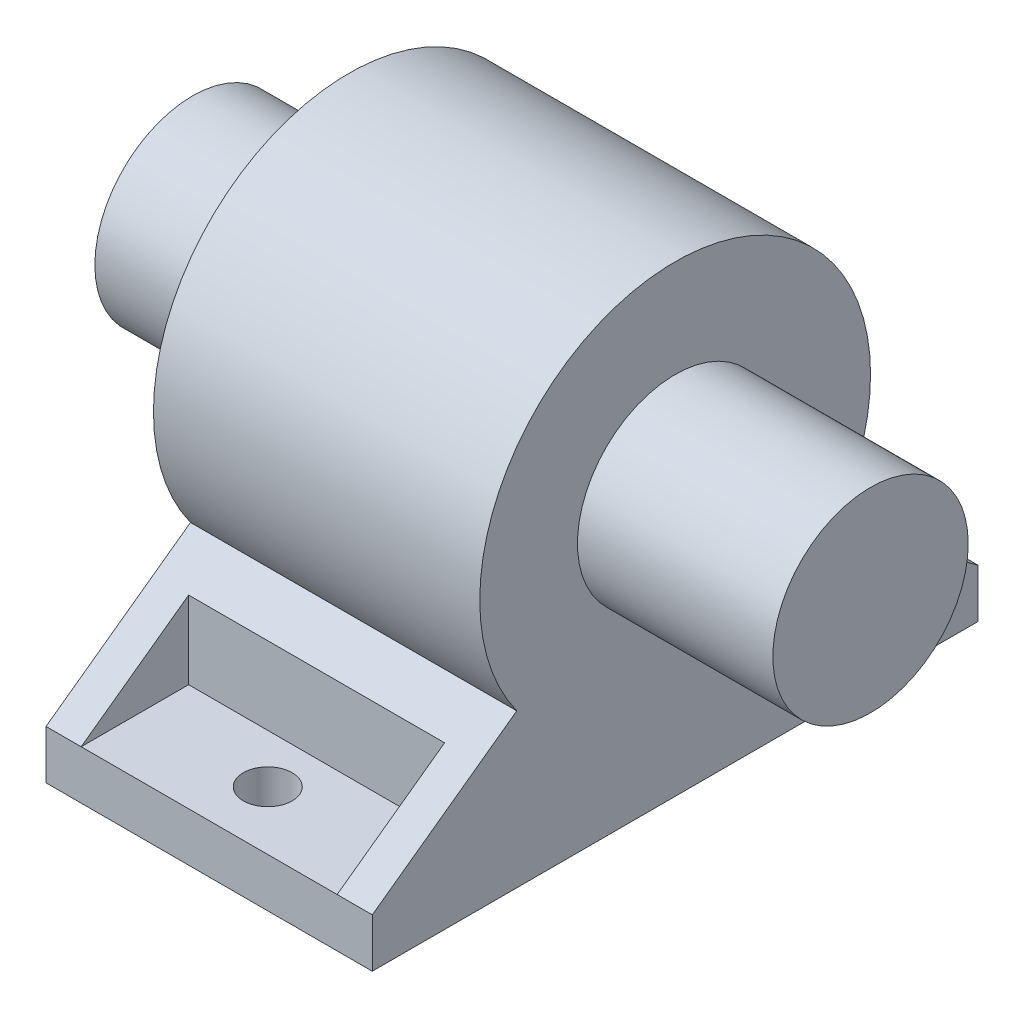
ISO-10303-21;
HEADER;
FILE_DESCRIPTION(('STEP AP214'),'2;1');
FILE_NAME('part.step','',(''),(''),'','','');
FILE_SCHEMA(('AUTOMOTIVE_DESIGN { 1 0 10303 214 1 1 1 1 }'));
ENDSEC;
DATA;
#1=APPLICATION_CONTEXT('core data for automotive mechanical design processes');
#2=APPLICATION_PROTOCOL_DEFINITION('international standard','automotive_design',2000,#1);
#3=PRODUCT_CONTEXT('',#1,'mechanical');
#4=PRODUCT('Part','Part','',(#3));
#5=PRODUCT_RELATED_PRODUCT_CATEGORY('part','',(#4));
#6=PRODUCT_DEFINITION_FORMATION('','',#4);
#7=PRODUCT_DEFINITION_CONTEXT('part definition',#1,'design');
#8=PRODUCT_DEFINITION('design','',#6,#7);
#9=PRODUCT_DEFINITION_SHAPE('','',#8);
#10=(LENGTH_UNIT() NAMED_UNIT(*) SI_UNIT(.MILLI.,.METRE.));
#11=(NAMED_UNIT(*) PLANE_ANGLE_UNIT() SI_UNIT($,.RADIAN.));
#12=(NAMED_UNIT(*) SI_UNIT($,.STERADIAN.) SOLID_ANGLE_UNIT());
#13=UNCERTAINTY_MEASURE_WITH_UNIT(LENGTH_MEASURE(1.E-05),#10,'distance_accuracy_value','');
#14=(GEOMETRIC_REPRESENTATION_CONTEXT(3) GLOBAL_UNCERTAINTY_ASSIGNED_CONTEXT((#13)) GLOBAL_UNIT_ASSIGNED_CONTEXT((#10,
#11,#12)) REPRESENTATION_CONTEXT('',''));
#15=CARTESIAN_POINT('',(0.,0.,0.));
#16=DIRECTION('',(0.,0.,1.));
#17=DIRECTION('',(1.,0.,0.));
#18=AXIS2_PLACEMENT_3D('',#15,#16,#17);
#19=CARTESIAN_POINT('',(42.418,-28.448,39.37));
#20=DIRECTION('',(0.,0.,-1.));
#21=DIRECTION('',(0.,1.,0.));
#22=AXIS2_PLACEMENT_3D('',#19,#20,#21);
#23=PLANE('',#22);
#24=DIRECTION('',(0.,-1.,0.));
#25=VECTOR('',#24,1.);
#26=CARTESIAN_POINT('',(0.,-28.448,39.37));
#27=LINE('',#26,#25);
#28=CARTESIAN_POINT('',(0.,-28.448,39.37));
#29=VERTEX_POINT('',#28);
#30=CARTESIAN_POINT('',(0.,-34.798,39.37));
#31=VERTEX_POINT('',#30);
#32=EDGE_CURVE('E229',#29,#31,#27,.T.);
#33=ORIENTED_EDGE('',*,*,#32,.T.);
#34=DIRECTION('',(-1.,0.,0.));
#35=VECTOR('',#34,1.);
#36=CARTESIAN_POINT('',(42.418,-34.798,39.37));
#37=LINE('',#36,#35);
#38=CARTESIAN_POINT('',(42.418,-34.798,39.37));
#39=VERTEX_POINT('',#38);
#40=EDGE_CURVE('E176',#39,#31,#37,.T.);
#41=ORIENTED_EDGE('',*,*,#40,.F.);
#42=DIRECTION('',(0.,-1.,0.));
#43=VECTOR('',#42,1.);
#44=CARTESIAN_POINT('',(42.418,-28.448,39.37));
#45=LINE('',#44,#43);
#46=CARTESIAN_POINT('',(42.418,-28.448,39.37));
#47=VERTEX_POINT('',#46);
#48=EDGE_CURVE('E155',#47,#39,#45,.T.);
#49=ORIENTED_EDGE('',*,*,#48,.F.);
#50=DIRECTION('',(-1.,0.,0.));
#51=VECTOR('',#50,1.);
#52=CARTESIAN_POINT('',(42.418,-28.448,39.37));
#53=LINE('',#52,#51);
#54=CARTESIAN_POINT('',(37.846,-28.448,39.37));
#55=VERTEX_POINT('',#54);
#56=EDGE_CURVE('E148',#47,#55,#53,.T.);
#57=ORIENTED_EDGE('',*,*,#56,.T.);
#58=DIRECTION('',(-1.,0.,0.));
#59=VECTOR('',#58,1.);
#60=CARTESIAN_POINT('',(4.57200000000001,-28.448,39.37));
#61=LINE('',#60,#59);
#62=CARTESIAN_POINT('',(4.57200000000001,-28.448,39.37));
#63=VERTEX_POINT('',#62);
#64=EDGE_CURVE('E136',#55,#63,#61,.T.);
#65=ORIENTED_EDGE('',*,*,#64,.T.);
#66=EDGE_CURVE('E157',#63,#29,#53,.T.);
#67=ORIENTED_EDGE('',*,*,#66,.T.);
#68=EDGE_LOOP('',(#33,#41,#49,#57,#65,#67));
#69=FACE_BOUND('',#68,.T.);
#70=ADVANCED_FACE('F34',(#69),#23,.F.);
#71=CARTESIAN_POINT('',(42.418,-34.798,39.37));
#72=DIRECTION('',(0.,1.,0.));
#73=DIRECTION('',(0.,0.,1.));
#74=AXIS2_PLACEMENT_3D('',#71,#72,#73);
#75=PLANE('',#74);
#76=CARTESIAN_POINT('',(21.209,-34.798,-31.75));
#77=DIRECTION('',(0.,1.,0.));
#78=DIRECTION('',(0.,0.,1.));
#79=AXIS2_PLACEMENT_3D('',#76,#77,#78);
#80=CIRCLE('',#79,3.175);
#81=CARTESIAN_POINT('',(21.209,-34.798,-28.575));
#82=VERTEX_POINT('',#81);
#83=EDGE_CURVE('E183',#82,#82,#80,.T.);
#84=ORIENTED_EDGE('',*,*,#83,.T.);
#85=EDGE_LOOP('',(#84));
#86=FACE_BOUND('',#85,.T.);
#87=CARTESIAN_POINT('',(21.209,-34.798,31.75));
#88=DIRECTION('',(0.,1.,0.));
#89=DIRECTION('',(0.,0.,1.));
#90=AXIS2_PLACEMENT_3D('',#87,#88,#89);
#91=CIRCLE('',#90,3.175);
#92=CARTESIAN_POINT('',(21.209,-34.798,34.925));
#93=VERTEX_POINT('',#92);
#94=EDGE_CURVE('E189',#93,#93,#91,.T.);
#95=ORIENTED_EDGE('',*,*,#94,.T.);
#96=EDGE_LOOP('',(#95));
#97=FACE_BOUND('',#96,.T.);
#98=DIRECTION('',(0.,0.,-1.));
#99=VECTOR('',#98,1.);
#100=CARTESIAN_POINT('',(0.,-34.798,39.37));
#101=LINE('',#100,#99);
#102=CARTESIAN_POINT('',(0.,-34.798,-39.37));
#103=VERTEX_POINT('',#102);
#104=EDGE_CURVE('E243',#31,#103,#101,.T.);
#105=ORIENTED_EDGE('',*,*,#104,.T.);
#106=DIRECTION('',(-1.,0.,0.));
#107=VECTOR('',#106,1.);
#108=CARTESIAN_POINT('',(42.418,-34.798,-39.37));
#109=LINE('',#108,#107);
#110=CARTESIAN_POINT('',(42.418,-34.798,-39.37));
#111=VERTEX_POINT('',#110);
#112=EDGE_CURVE('E173',#111,#103,#109,.T.);
#113=ORIENTED_EDGE('',*,*,#112,.F.);
#114=DIRECTION('',(0.,0.,-1.));
#115=VECTOR('',#114,1.);
#116=CARTESIAN_POINT('',(42.418,-34.798,39.37));
#117=LINE('',#116,#115);
#118=EDGE_CURVE('E233',#39,#111,#117,.T.);
#119=ORIENTED_EDGE('',*,*,#118,.F.);
#120=ORIENTED_EDGE('',*,*,#40,.T.);
#121=EDGE_LOOP('',(#105,#113,#119,#120));
#122=FACE_BOUND('',#121,.T.);
#123=ADVANCED_FACE('F260',(#86,#97,#122),#75,.F.);
#124=CARTESIAN_POINT('',(42.418,-34.798,-39.37));
#125=DIRECTION('',(0.,0.,1.));
#126=DIRECTION('',(0.,-1.,0.));
#127=AXIS2_PLACEMENT_3D('',#124,#125,#126);
#128=PLANE('',#127);
#129=DIRECTION('',(0.,1.,0.));
#130=VECTOR('',#129,1.);
#131=CARTESIAN_POINT('',(0.,-34.798,-39.37));
#132=LINE('',#131,#130);
#133=CARTESIAN_POINT('',(0.,-28.448,-39.37));
#134=VERTEX_POINT('',#133);
#135=EDGE_CURVE('E245',#103,#134,#132,.T.);
#136=ORIENTED_EDGE('',*,*,#135,.T.);
#137=DIRECTION('',(-1.,0.,0.));
#138=VECTOR('',#137,1.);
#139=CARTESIAN_POINT('',(42.418,-28.448,-39.37));
#140=LINE('',#139,#138);
#141=CARTESIAN_POINT('',(4.572,-28.448,-39.37));
#142=VERTEX_POINT('',#141);
#143=EDGE_CURVE('E169',#142,#134,#140,.T.);
#144=ORIENTED_EDGE('',*,*,#143,.F.);
#145=DIRECTION('',(1.,0.,0.));
#146=VECTOR('',#145,1.);
#147=CARTESIAN_POINT('',(4.572,-28.448,-39.37));
#148=LINE('',#147,#146);
#149=CARTESIAN_POINT('',(37.846,-28.448,-39.37));
#150=VERTEX_POINT('',#149);
#151=EDGE_CURVE('E203',#142,#150,#148,.T.);
#152=ORIENTED_EDGE('',*,*,#151,.T.);
#153=CARTESIAN_POINT('',(42.418,-28.448,-39.37));
#154=VERTEX_POINT('',#153);
#155=EDGE_CURVE('E170',#154,#150,#140,.T.);
#156=ORIENTED_EDGE('',*,*,#155,.F.);
#157=DIRECTION('',(0.,1.,0.));
#158=VECTOR('',#157,1.);
#159=CARTESIAN_POINT('',(42.418,-34.798,-39.37));
#160=LINE('',#159,#158);
#161=EDGE_CURVE('E235',#111,#154,#160,.T.);
#162=ORIENTED_EDGE('',*,*,#161,.F.);
#163=ORIENTED_EDGE('',*,*,#112,.T.);
#164=EDGE_LOOP('',(#136,#144,#152,#156,#162,#163));
#165=FACE_BOUND('',#164,.T.);
#166=ADVANCED_FACE('F277',(#165),#128,.F.);
#167=CARTESIAN_POINT('',(42.418,-28.448,-39.37));
#168=DIRECTION('',(0.,-0.810541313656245,0.585681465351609));
#169=DIRECTION('',(0.,-0.585681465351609,-0.810541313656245));
#170=AXIS2_PLACEMENT_3D('',#167,#168,#169);
#171=PLANE('',#170);
#172=DIRECTION('',(-1.,0.,0.));
#173=VECTOR('',#172,1.);
#174=CARTESIAN_POINT('',(42.418,-18.3535483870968,-25.4));
#175=LINE('',#174,#173);
#176=CARTESIAN_POINT('',(37.846,-18.3535483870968,-25.4));
#177=VERTEX_POINT('',#176);
#178=CARTESIAN_POINT('',(4.572,-18.3535483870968,-25.4));
#179=VERTEX_POINT('',#178);
#180=EDGE_CURVE('E140',#177,#179,#175,.T.);
#181=ORIENTED_EDGE('',*,*,#180,.T.);
#182=DIRECTION('',(0.,-0.585681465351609,-0.810541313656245));
#183=VECTOR('',#182,1.);
#184=CARTESIAN_POINT('',(4.572,-28.448,-39.37));
#185=LINE('',#184,#183);
#186=EDGE_CURVE('E219',#179,#142,#185,.T.);
#187=ORIENTED_EDGE('',*,*,#186,.T.);
#188=ORIENTED_EDGE('',*,*,#143,.T.);
#189=DIRECTION('',(0.,0.585681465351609,0.810541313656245));
#190=VECTOR('',#189,1.);
#191=CARTESIAN_POINT('',(0.,-28.448,-39.37));
#192=LINE('',#191,#190);
#193=CARTESIAN_POINT('',(0.,-14.8763092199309,-20.5877493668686));
#194=VERTEX_POINT('',#193);
#195=EDGE_CURVE('E248',#134,#194,#192,.T.);
#196=ORIENTED_EDGE('',*,*,#195,.T.);
#197=DIRECTION('',(-1.,0.,0.));
#198=VECTOR('',#197,1.);
#199=CARTESIAN_POINT('',(42.418,-14.8763092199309,-20.5877493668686));
#200=LINE('',#199,#198);
#201=CARTESIAN_POINT('',(42.418,-14.8763092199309,-20.5877493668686));
#202=VERTEX_POINT('',#201);
#203=EDGE_CURVE('E160',#202,#194,#200,.T.);
#204=ORIENTED_EDGE('',*,*,#203,.F.);
#205=DIRECTION('',(0.,0.585681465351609,0.810541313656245));
#206=VECTOR('',#205,1.);
#207=CARTESIAN_POINT('',(42.418,-28.448,-39.37));
#208=LINE('',#207,#206);
#209=EDGE_CURVE('E237',#154,#202,#208,.T.);
#210=ORIENTED_EDGE('',*,*,#209,.F.);
#211=ORIENTED_EDGE('',*,*,#155,.T.);
#212=DIRECTION('',(0.,0.585681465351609,0.810541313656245));
#213=VECTOR('',#212,1.);
#214=CARTESIAN_POINT('',(37.846,-28.448,-39.37));
#215=LINE('',#214,#213);
#216=EDGE_CURVE('E216',#150,#177,#215,.T.);
#217=ORIENTED_EDGE('',*,*,#216,.T.);
#218=EDGE_LOOP('',(#181,#187,#188,#196,#204,#210,#211,#217));
#219=FACE_BOUND('',#218,.T.);
#220=ADVANCED_FACE('F270',(#219),#171,.F.);
#221=CARTESIAN_POINT('',(42.418,0.,0.));
#222=DIRECTION('',(-1.,0.,0.));
#223=DIRECTION('',(0.,0.,1.));
#224=AXIS2_PLACEMENT_3D('',#221,#222,#223);
#225=CYLINDRICAL_SURFACE('',#224,25.4);
#226=CARTESIAN_POINT('',(0.,0.,0.));
#227=DIRECTION('',(1.,0.,0.));
#228=DIRECTION('',(0.,0.,-1.));
#229=AXIS2_PLACEMENT_3D('',#226,#227,#228);
#230=CIRCLE('',#229,25.4);
#231=CARTESIAN_POINT('',(0.,-14.8763092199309,20.5877493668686));
#232=VERTEX_POINT('',#231);
#233=EDGE_CURVE('E249',#194,#232,#230,.T.);
#234=ORIENTED_EDGE('',*,*,#233,.T.);
#235=DIRECTION('',(-1.,0.,0.));
#236=VECTOR('',#235,1.);
#237=CARTESIAN_POINT('',(42.418,-14.8763092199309,20.5877493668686));
#238=LINE('',#237,#236);
#239=CARTESIAN_POINT('',(42.418,-14.8763092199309,20.5877493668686));
#240=VERTEX_POINT('',#239);
#241=EDGE_CURVE('E156',#240,#232,#238,.T.);
#242=ORIENTED_EDGE('',*,*,#241,.F.);
#243=CARTESIAN_POINT('',(42.418,0.,0.));
#244=DIRECTION('',(1.,0.,0.));
#245=DIRECTION('',(0.,0.,-1.));
#246=AXIS2_PLACEMENT_3D('',#243,#244,#245);
#247=CIRCLE('',#246,25.4);
#248=EDGE_CURVE('E239',#202,#240,#247,.T.);
#249=ORIENTED_EDGE('',*,*,#248,.F.);
#250=ORIENTED_EDGE('',*,*,#203,.T.);
#251=EDGE_LOOP('',(#234,#242,#249,#250));
#252=FACE_BOUND('',#251,.T.);
#253=ADVANCED_FACE('F268',(#252),#225,.T.);
#254=CARTESIAN_POINT('',(42.418,-14.8763092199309,20.5877493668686));
#255=DIRECTION('',(0.,-0.810541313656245,-0.585681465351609));
#256=DIRECTION('',(0.,0.585681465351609,-0.810541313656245));
#257=AXIS2_PLACEMENT_3D('',#254,#255,#256);
#258=PLANE('',#257);
#259=ORIENTED_EDGE('',*,*,#66,.F.);
#260=DIRECTION('',(0.,0.585681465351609,-0.810541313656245));
#261=VECTOR('',#260,1.);
#262=CARTESIAN_POINT('',(4.57200000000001,-14.8763092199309,20.5877493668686));
#263=LINE('',#262,#261);
#264=CARTESIAN_POINT('',(4.57200000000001,-18.3535483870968,25.4));
#265=VERTEX_POINT('',#264);
#266=EDGE_CURVE('E12',#63,#265,#263,.T.);
#267=ORIENTED_EDGE('',*,*,#266,.T.);
#268=DIRECTION('',(1.,0.,0.));
#269=VECTOR('',#268,1.);
#270=CARTESIAN_POINT('',(42.418,-18.3535483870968,25.4));
#271=LINE('',#270,#269);
#272=CARTESIAN_POINT('',(37.846,-18.3535483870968,25.4));
#273=VERTEX_POINT('',#272);
#274=EDGE_CURVE('E42',#265,#273,#271,.T.);
#275=ORIENTED_EDGE('',*,*,#274,.T.);
#276=DIRECTION('',(0.,-0.585681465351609,0.810541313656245));
#277=VECTOR('',#276,1.);
#278=CARTESIAN_POINT('',(37.846,-14.8763092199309,20.5877493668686));
#279=LINE('',#278,#277);
#280=EDGE_CURVE('E129',#273,#55,#279,.T.);
#281=ORIENTED_EDGE('',*,*,#280,.T.);
#282=ORIENTED_EDGE('',*,*,#56,.F.);
#283=DIRECTION('',(0.,-0.585681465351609,0.810541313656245));
#284=VECTOR('',#283,1.);
#285=CARTESIAN_POINT('',(42.418,-14.8763092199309,20.5877493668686));
#286=LINE('',#285,#284);
#287=EDGE_CURVE('E162',#240,#47,#286,.T.);
#288=ORIENTED_EDGE('',*,*,#287,.F.);
#289=ORIENTED_EDGE('',*,*,#241,.T.);
#290=DIRECTION('',(0.,-0.585681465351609,0.810541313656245));
#291=VECTOR('',#290,1.);
#292=CARTESIAN_POINT('',(0.,-14.8763092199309,20.5877493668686));
#293=LINE('',#292,#291);
#294=EDGE_CURVE('E164',#232,#29,#293,.T.);
#295=ORIENTED_EDGE('',*,*,#294,.T.);
#296=EDGE_LOOP('',(#259,#267,#275,#281,#282,#288,#289,#295));
#297=FACE_BOUND('',#296,.T.);
#298=ADVANCED_FACE('F146',(#297),#258,.F.);
#299=CARTESIAN_POINT('',(42.418,0.,0.));
#300=DIRECTION('',(1.,0.,0.));
#301=DIRECTION('',(0.,0.,-1.));
#302=AXIS2_PLACEMENT_3D('',#299,#300,#301);
#303=PLANE('',#302);
#304=CARTESIAN_POINT('',(42.418,0.,0.));
#305=DIRECTION('',(1.,0.,0.));
#306=DIRECTION('',(0.,0.,-1.));
#307=AXIS2_PLACEMENT_3D('',#304,#305,#306);
#308=CIRCLE('',#307,12.7);
#309=CARTESIAN_POINT('',(42.418,0.,-12.7));
#310=VERTEX_POINT('',#309);
#311=EDGE_CURVE('E225',#310,#310,#308,.T.);
#312=ORIENTED_EDGE('',*,*,#311,.F.);
#313=EDGE_LOOP('',(#312));
#314=FACE_BOUND('',#313,.T.);
#315=ORIENTED_EDGE('',*,*,#48,.T.);
#316=ORIENTED_EDGE('',*,*,#118,.T.);
#317=ORIENTED_EDGE('',*,*,#161,.T.);
#318=ORIENTED_EDGE('',*,*,#209,.T.);
#319=ORIENTED_EDGE('',*,*,#248,.T.);
#320=ORIENTED_EDGE('',*,*,#287,.T.);
#321=EDGE_LOOP('',(#315,#316,#317,#318,#319,#320));
#322=FACE_BOUND('',#321,.T.);
#323=ADVANCED_FACE('F264',(#314,#322),#303,.T.);
#324=CARTESIAN_POINT('',(0.,0.,0.));
#325=DIRECTION('',(1.,0.,0.));
#326=DIRECTION('',(0.,0.,-1.));
#327=AXIS2_PLACEMENT_3D('',#324,#325,#326);
#328=PLANE('',#327);
#329=CARTESIAN_POINT('',(0.,0.,0.));
#330=DIRECTION('',(1.,0.,0.));
#331=DIRECTION('',(0.,0.,-1.));
#332=AXIS2_PLACEMENT_3D('',#329,#330,#331);
#333=CIRCLE('',#332,12.7);
#334=CARTESIAN_POINT('',(0.,0.,-12.7));
#335=VERTEX_POINT('',#334);
#336=EDGE_CURVE('E150',#335,#335,#333,.F.);
#337=ORIENTED_EDGE('',*,*,#336,.F.);
#338=EDGE_LOOP('',(#337));
#339=FACE_BOUND('',#338,.T.);
#340=ORIENTED_EDGE('',*,*,#32,.F.);
#341=ORIENTED_EDGE('',*,*,#294,.F.);
#342=ORIENTED_EDGE('',*,*,#233,.F.);
#343=ORIENTED_EDGE('',*,*,#195,.F.);
#344=ORIENTED_EDGE('',*,*,#135,.F.);
#345=ORIENTED_EDGE('',*,*,#104,.F.);
#346=EDGE_LOOP('',(#340,#341,#342,#343,#344,#345));
#347=FACE_BOUND('',#346,.T.);
#348=ADVANCED_FACE('F257',(#339,#347),#328,.F.);
#349=CARTESIAN_POINT('',(67.818,0.,0.));
#350=DIRECTION('',(-1.,0.,0.));
#351=DIRECTION('',(0.,0.,1.));
#352=AXIS2_PLACEMENT_3D('',#349,#350,#351);
#353=CYLINDRICAL_SURFACE('',#352,12.7);
#354=CARTESIAN_POINT('',(67.818,0.,0.));
#355=DIRECTION('',(1.,0.,0.));
#356=DIRECTION('',(0.,0.,-1.));
#357=AXIS2_PLACEMENT_3D('',#354,#355,#356);
#358=CIRCLE('',#357,12.7);
#359=CARTESIAN_POINT('',(67.818,0.,-12.7));
#360=VERTEX_POINT('',#359);
#361=EDGE_CURVE('E226',#360,#360,#358,.T.);
#362=ORIENTED_EDGE('',*,*,#361,.F.);
#363=EDGE_LOOP('',(#362));
#364=FACE_BOUND('',#363,.T.);
#365=ORIENTED_EDGE('',*,*,#311,.T.);
#366=EDGE_LOOP('',(#365));
#367=FACE_BOUND('',#366,.T.);
#368=ADVANCED_FACE('F343',(#364,#367),#353,.T.);
#369=CARTESIAN_POINT('',(67.818,0.,0.));
#370=DIRECTION('',(1.,0.,0.));
#371=DIRECTION('',(0.,0.,-1.));
#372=AXIS2_PLACEMENT_3D('',#369,#370,#371);
#373=PLANE('',#372);
#374=ORIENTED_EDGE('',*,*,#361,.T.);
#375=EDGE_LOOP('',(#374));
#376=FACE_BOUND('',#375,.T.);
#377=ADVANCED_FACE('F339',(#376),#373,.T.);
#378=CARTESIAN_POINT('',(-20.32,0.,0.));
#379=DIRECTION('',(1.,0.,0.));
#380=DIRECTION('',(0.,0.,-1.));
#381=AXIS2_PLACEMENT_3D('',#378,#379,#380);
#382=CYLINDRICAL_SURFACE('',#381,12.7);
#383=CARTESIAN_POINT('',(-20.32,0.,0.));
#384=DIRECTION('',(-1.,0.,0.));
#385=DIRECTION('',(0.,0.,1.));
#386=AXIS2_PLACEMENT_3D('',#383,#384,#385);
#387=CIRCLE('',#386,12.7);
#388=CARTESIAN_POINT('',(-20.32,0.,12.7));
#389=VERTEX_POINT('',#388);
#390=EDGE_CURVE('E222',#389,#389,#387,.T.);
#391=ORIENTED_EDGE('',*,*,#390,.F.);
#392=EDGE_LOOP('',(#391));
#393=FACE_BOUND('',#392,.T.);
#394=ORIENTED_EDGE('',*,*,#336,.T.);
#395=EDGE_LOOP('',(#394));
#396=FACE_BOUND('',#395,.T.);
#397=ADVANCED_FACE('F335',(#393,#396),#382,.T.);
#398=CARTESIAN_POINT('',(-20.32,0.,0.));
#399=DIRECTION('',(-1.,0.,0.));
#400=DIRECTION('',(0.,0.,1.));
#401=AXIS2_PLACEMENT_3D('',#398,#399,#400);
#402=PLANE('',#401);
#403=ORIENTED_EDGE('',*,*,#390,.T.);
#404=EDGE_LOOP('',(#403));
#405=FACE_BOUND('',#404,.T.);
#406=ADVANCED_FACE('F317',(#405),#402,.T.);
#407=CARTESIAN_POINT('',(4.57200000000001,-70.885670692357,39.37));
#408=DIRECTION('',(-1.,0.,0.));
#409=DIRECTION('',(0.,0.,1.));
#410=AXIS2_PLACEMENT_3D('',#407,#408,#409);
#411=PLANE('',#410);
#412=DIRECTION('',(0.,0.,-1.));
#413=VECTOR('',#412,1.);
#414=CARTESIAN_POINT('',(4.57200000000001,-28.448,39.37));
#415=LINE('',#414,#413);
#416=CARTESIAN_POINT('',(4.57200000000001,-28.448,25.4));
#417=VERTEX_POINT('',#416);
#418=EDGE_CURVE('E58',#63,#417,#415,.T.);
#419=ORIENTED_EDGE('',*,*,#418,.T.);
#420=DIRECTION('',(0.,1.,0.));
#421=VECTOR('',#420,1.);
#422=CARTESIAN_POINT('',(4.57200000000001,-70.885670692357,25.4));
#423=LINE('',#422,#421);
#424=EDGE_CURVE('E133',#417,#265,#423,.T.);
#425=ORIENTED_EDGE('',*,*,#424,.T.);
#426=ORIENTED_EDGE('',*,*,#266,.F.);
#427=EDGE_LOOP('',(#419,#425,#426));
#428=FACE_BOUND('',#427,.T.);
#429=ADVANCED_FACE('F311',(#428),#411,.F.);
#430=CARTESIAN_POINT('',(4.57200000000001,-70.885670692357,25.4));
#431=DIRECTION('',(0.,0.,-1.));
#432=DIRECTION('',(-1.,0.,0.));
#433=AXIS2_PLACEMENT_3D('',#430,#431,#432);
#434=PLANE('',#433);
#435=ORIENTED_EDGE('',*,*,#424,.F.);
#436=DIRECTION('',(1.,0.,0.));
#437=VECTOR('',#436,1.);
#438=CARTESIAN_POINT('',(4.57200000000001,-28.448,25.4));
#439=LINE('',#438,#437);
#440=CARTESIAN_POINT('',(37.846,-28.448,25.4));
#441=VERTEX_POINT('',#440);
#442=EDGE_CURVE('E132',#417,#441,#439,.T.);
#443=ORIENTED_EDGE('',*,*,#442,.T.);
#444=DIRECTION('',(0.,1.,0.));
#445=VECTOR('',#444,1.);
#446=CARTESIAN_POINT('',(37.846,-70.885670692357,25.4));
#447=LINE('',#446,#445);
#448=EDGE_CURVE('E131',#441,#273,#447,.T.);
#449=ORIENTED_EDGE('',*,*,#448,.T.);
#450=ORIENTED_EDGE('',*,*,#274,.F.);
#451=EDGE_LOOP('',(#435,#443,#449,#450));
#452=FACE_BOUND('',#451,.T.);
#453=ADVANCED_FACE('F308',(#452),#434,.F.);
#454=CARTESIAN_POINT('',(37.846,-70.885670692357,39.37));
#455=DIRECTION('',(1.,0.,0.));
#456=DIRECTION('',(0.,0.,-1.));
#457=AXIS2_PLACEMENT_3D('',#454,#455,#456);
#458=PLANE('',#457);
#459=ORIENTED_EDGE('',*,*,#448,.F.);
#460=DIRECTION('',(0.,0.,1.));
#461=VECTOR('',#460,1.);
#462=CARTESIAN_POINT('',(37.846,-28.448,39.37));
#463=LINE('',#462,#461);
#464=EDGE_CURVE('E126',#441,#55,#463,.T.);
#465=ORIENTED_EDGE('',*,*,#464,.T.);
#466=ORIENTED_EDGE('',*,*,#280,.F.);
#467=EDGE_LOOP('',(#459,#465,#466));
#468=FACE_BOUND('',#467,.T.);
#469=ADVANCED_FACE('F127',(#468),#458,.F.);
#470=CARTESIAN_POINT('',(42.418,-28.448,39.37));
#471=DIRECTION('',(0.,1.,0.));
#472=DIRECTION('',(0.,0.,1.));
#473=AXIS2_PLACEMENT_3D('',#470,#471,#472);
#474=PLANE('',#473);
#475=CARTESIAN_POINT('',(21.209,-28.448,31.75));
#476=DIRECTION('',(0.,1.,0.));
#477=DIRECTION('',(0.,0.,1.));
#478=AXIS2_PLACEMENT_3D('',#475,#476,#477);
#479=CIRCLE('',#478,3.175);
#480=CARTESIAN_POINT('',(21.209,-28.448,34.925));
#481=VERTEX_POINT('',#480);
#482=EDGE_CURVE('E37',#481,#481,#479,.T.);
#483=ORIENTED_EDGE('',*,*,#482,.F.);
#484=EDGE_LOOP('',(#483));
#485=FACE_BOUND('',#484,.T.);
#486=ORIENTED_EDGE('',*,*,#418,.F.);
#487=ORIENTED_EDGE('',*,*,#64,.F.);
#488=ORIENTED_EDGE('',*,*,#464,.F.);
#489=ORIENTED_EDGE('',*,*,#442,.F.);
#490=EDGE_LOOP('',(#486,#487,#488,#489));
#491=FACE_BOUND('',#490,.T.);
#492=ADVANCED_FACE('F137',(#485,#491),#474,.T.);
#493=CARTESIAN_POINT('',(4.572,-70.885670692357,-39.37));
#494=DIRECTION('',(-1.,0.,0.));
#495=DIRECTION('',(0.,0.,1.));
#496=AXIS2_PLACEMENT_3D('',#493,#494,#495);
#497=PLANE('',#496);
#498=DIRECTION('',(0.,1.,0.));
#499=VECTOR('',#498,1.);
#500=CARTESIAN_POINT('',(4.572,-70.885670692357,-25.4));
#501=LINE('',#500,#499);
#502=CARTESIAN_POINT('',(4.572,-28.448,-25.4));
#503=VERTEX_POINT('',#502);
#504=EDGE_CURVE('E187',#503,#179,#501,.T.);
#505=ORIENTED_EDGE('',*,*,#504,.F.);
#506=DIRECTION('',(0.,0.,-1.));
#507=VECTOR('',#506,1.);
#508=CARTESIAN_POINT('',(4.572,-28.448,-39.37));
#509=LINE('',#508,#507);
#510=EDGE_CURVE('E207',#503,#142,#509,.T.);
#511=ORIENTED_EDGE('',*,*,#510,.T.);
#512=ORIENTED_EDGE('',*,*,#186,.F.);
#513=EDGE_LOOP('',(#505,#511,#512));
#514=FACE_BOUND('',#513,.T.);
#515=ADVANCED_FACE('F306',(#514),#497,.F.);
#516=CARTESIAN_POINT('',(37.846,-70.885670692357,-39.37));
#517=DIRECTION('',(1.,0.,0.));
#518=DIRECTION('',(0.,0.,-1.));
#519=AXIS2_PLACEMENT_3D('',#516,#517,#518);
#520=PLANE('',#519);
#521=DIRECTION('',(0.,0.,1.));
#522=VECTOR('',#521,1.);
#523=CARTESIAN_POINT('',(37.846,-28.448,-39.37));
#524=LINE('',#523,#522);
#525=CARTESIAN_POINT('',(37.846,-28.448,-25.4));
#526=VERTEX_POINT('',#525);
#527=EDGE_CURVE('E50',#150,#526,#524,.T.);
#528=ORIENTED_EDGE('',*,*,#527,.T.);
#529=DIRECTION('',(0.,1.,0.));
#530=VECTOR('',#529,1.);
#531=CARTESIAN_POINT('',(37.846,-70.885670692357,-25.4));
#532=LINE('',#531,#530);
#533=EDGE_CURVE('E204',#526,#177,#532,.T.);
#534=ORIENTED_EDGE('',*,*,#533,.T.);
#535=ORIENTED_EDGE('',*,*,#216,.F.);
#536=EDGE_LOOP('',(#528,#534,#535));
#537=FACE_BOUND('',#536,.T.);
#538=ADVANCED_FACE('F323',(#537),#520,.F.);
#539=CARTESIAN_POINT('',(4.572,-70.885670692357,-25.4));
#540=DIRECTION('',(0.,0.,1.));
#541=DIRECTION('',(1.,0.,0.));
#542=AXIS2_PLACEMENT_3D('',#539,#540,#541);
#543=PLANE('',#542);
#544=ORIENTED_EDGE('',*,*,#533,.F.);
#545=DIRECTION('',(-1.,0.,0.));
#546=VECTOR('',#545,1.);
#547=CARTESIAN_POINT('',(4.572,-28.448,-25.4));
#548=LINE('',#547,#546);
#549=EDGE_CURVE('E200',#526,#503,#548,.T.);
#550=ORIENTED_EDGE('',*,*,#549,.T.);
#551=ORIENTED_EDGE('',*,*,#504,.T.);
#552=ORIENTED_EDGE('',*,*,#180,.F.);
#553=EDGE_LOOP('',(#544,#550,#551,#552));
#554=FACE_BOUND('',#553,.T.);
#555=ADVANCED_FACE('F321',(#554),#543,.F.);
#556=CARTESIAN_POINT('',(42.418,-28.448,39.37));
#557=DIRECTION('',(0.,1.,0.));
#558=DIRECTION('',(0.,0.,1.));
#559=AXIS2_PLACEMENT_3D('',#556,#557,#558);
#560=PLANE('',#559);
#561=CARTESIAN_POINT('',(21.209,-28.448,-31.75));
#562=DIRECTION('',(0.,1.,0.));
#563=DIRECTION('',(0.,0.,1.));
#564=AXIS2_PLACEMENT_3D('',#561,#562,#563);
#565=CIRCLE('',#564,3.175);
#566=CARTESIAN_POINT('',(21.209,-28.448,-28.575));
#567=VERTEX_POINT('',#566);
#568=EDGE_CURVE('E181',#567,#567,#565,.T.);
#569=ORIENTED_EDGE('',*,*,#568,.F.);
#570=EDGE_LOOP('',(#569));
#571=FACE_BOUND('',#570,.T.);
#572=ORIENTED_EDGE('',*,*,#510,.F.);
#573=ORIENTED_EDGE('',*,*,#549,.F.);
#574=ORIENTED_EDGE('',*,*,#527,.F.);
#575=ORIENTED_EDGE('',*,*,#151,.F.);
#576=EDGE_LOOP('',(#572,#573,#574,#575));
#577=FACE_BOUND('',#576,.T.);
#578=ADVANCED_FACE('F302',(#571,#577),#560,.T.);
#579=CARTESIAN_POINT('',(21.209,-34.798,-31.75));
#580=DIRECTION('',(0.,1.,0.));
#581=DIRECTION('',(0.,0.,1.));
#582=AXIS2_PLACEMENT_3D('',#579,#580,#581);
#583=CYLINDRICAL_SURFACE('',#582,3.175);
#584=ORIENTED_EDGE('',*,*,#568,.T.);
#585=EDGE_LOOP('',(#584));
#586=FACE_BOUND('',#585,.T.);
#587=ORIENTED_EDGE('',*,*,#83,.F.);
#588=EDGE_LOOP('',(#587));
#589=FACE_BOUND('',#588,.T.);
#590=ADVANCED_FACE('F296',(#586,#589),#583,.F.);
#591=CARTESIAN_POINT('',(21.209,-34.798,31.75));
#592=DIRECTION('',(0.,1.,0.));
#593=DIRECTION('',(0.,0.,1.));
#594=AXIS2_PLACEMENT_3D('',#591,#592,#593);
#595=CYLINDRICAL_SURFACE('',#594,3.175);
#596=ORIENTED_EDGE('',*,*,#482,.T.);
#597=EDGE_LOOP('',(#596));
#598=FACE_BOUND('',#597,.T.);
#599=ORIENTED_EDGE('',*,*,#94,.F.);
#600=EDGE_LOOP('',(#599));
#601=FACE_BOUND('',#600,.T.);
#602=ADVANCED_FACE('F294',(#598,#601),#595,.F.);
#603=CLOSED_SHELL('',(#70,#123,#166,#220,#253,#298,#323,#348,#368,#377,#397,#406,#429,#453,#469,
#492,#515,#538,#555,#578,#590,#602));
#604=MANIFOLD_SOLID_BREP('B2',#603);
#605=ADVANCED_BREP_SHAPE_REPRESENTATION('',(#18,#604),#14);
#606=SHAPE_DEFINITION_REPRESENTATION(#9,#605);
ENDSEC;
END-ISO-10303-21;
